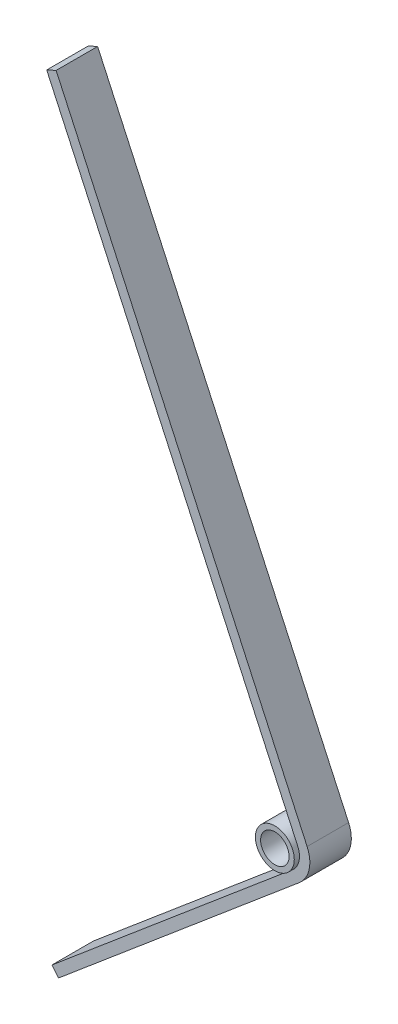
ISO-10303-21;
HEADER;
FILE_DESCRIPTION(('STEP AP214'),'2;1');
FILE_NAME('part.step','',(''),(''),'','','');
FILE_SCHEMA(('AUTOMOTIVE_DESIGN { 1 0 10303 214 1 1 1 1 }'));
ENDSEC;
DATA;
#1=APPLICATION_CONTEXT('core data for automotive mechanical design processes');
#2=APPLICATION_PROTOCOL_DEFINITION('international standard','automotive_design',2000,#1);
#3=PRODUCT_CONTEXT('',#1,'mechanical');
#4=PRODUCT('Part','Part','',(#3));
#5=PRODUCT_RELATED_PRODUCT_CATEGORY('part','',(#4));
#6=PRODUCT_DEFINITION_FORMATION('','',#4);
#7=PRODUCT_DEFINITION_CONTEXT('part definition',#1,'design');
#8=PRODUCT_DEFINITION('design','',#6,#7);
#9=PRODUCT_DEFINITION_SHAPE('','',#8);
#10=(LENGTH_UNIT() NAMED_UNIT(*) SI_UNIT(.MILLI.,.METRE.));
#11=(NAMED_UNIT(*) PLANE_ANGLE_UNIT() SI_UNIT($,.RADIAN.));
#12=(NAMED_UNIT(*) SI_UNIT($,.STERADIAN.) SOLID_ANGLE_UNIT());
#13=UNCERTAINTY_MEASURE_WITH_UNIT(LENGTH_MEASURE(1.E-05),#10,'distance_accuracy_value','');
#14=(GEOMETRIC_REPRESENTATION_CONTEXT(3) GLOBAL_UNCERTAINTY_ASSIGNED_CONTEXT((#13)) GLOBAL_UNIT_ASSIGNED_CONTEXT((#10,
#11,#12)) REPRESENTATION_CONTEXT('',''));
#15=CARTESIAN_POINT('',(0.,0.,0.));
#16=DIRECTION('',(0.,0.,1.));
#17=DIRECTION('',(1.,0.,0.));
#18=AXIS2_PLACEMENT_3D('',#15,#16,#17);
#19=CARTESIAN_POINT('',(0.,0.,15.875));
#20=DIRECTION('',(0.,0.,1.));
#21=DIRECTION('',(1.,0.,0.));
#22=AXIS2_PLACEMENT_3D('',#19,#20,#21);
#23=PLANE('',#22);
#24=CARTESIAN_POINT('',(0.,0.,15.875));
#25=DIRECTION('',(0.,0.,1.));
#26=DIRECTION('',(1.,0.,0.));
#27=AXIS2_PLACEMENT_3D('',#24,#25,#26);
#28=CIRCLE('',#27,11.90625);
#29=CARTESIAN_POINT('',(11.90625,0.,15.875));
#30=VERTEX_POINT('',#29);
#31=EDGE_CURVE('E11',#30,#30,#28,.T.);
#32=ORIENTED_EDGE('',*,*,#31,.T.);
#33=EDGE_LOOP('',(#32));
#34=FACE_BOUND('',#33,.T.);
#35=CARTESIAN_POINT('',(0.,0.,15.875));
#36=DIRECTION('',(0.,0.,1.));
#37=DIRECTION('',(1.,0.,0.));
#38=AXIS2_PLACEMENT_3D('',#35,#36,#37);
#39=CIRCLE('',#38,8.73125);
#40=CARTESIAN_POINT('',(8.73125,0.,15.875));
#41=VERTEX_POINT('',#40);
#42=EDGE_CURVE('E203',#41,#41,#39,.T.);
#43=ORIENTED_EDGE('',*,*,#42,.F.);
#44=EDGE_LOOP('',(#43));
#45=FACE_BOUND('',#44,.T.);
#46=ADVANCED_FACE('F44',(#34,#45),#23,.T.);
#47=CARTESIAN_POINT('',(0.,0.,-15.875));
#48=DIRECTION('',(0.,0.,1.));
#49=DIRECTION('',(1.,0.,0.));
#50=AXIS2_PLACEMENT_3D('',#47,#48,#49);
#51=PLANE('',#50);
#52=CARTESIAN_POINT('',(0.,0.,-15.875));
#53=DIRECTION('',(0.,0.,1.));
#54=DIRECTION('',(1.,0.,0.));
#55=AXIS2_PLACEMENT_3D('',#52,#53,#54);
#56=CIRCLE('',#55,11.90625);
#57=CARTESIAN_POINT('',(11.90625,0.,-15.875));
#58=VERTEX_POINT('',#57);
#59=EDGE_CURVE('E47',#58,#58,#56,.T.);
#60=ORIENTED_EDGE('',*,*,#59,.F.);
#61=EDGE_LOOP('',(#60));
#62=FACE_BOUND('',#61,.T.);
#63=CARTESIAN_POINT('',(0.,0.,-15.875));
#64=DIRECTION('',(0.,0.,1.));
#65=DIRECTION('',(1.,0.,0.));
#66=AXIS2_PLACEMENT_3D('',#63,#64,#65);
#67=CIRCLE('',#66,8.73125);
#68=CARTESIAN_POINT('',(8.73125,0.,-15.875));
#69=VERTEX_POINT('',#68);
#70=EDGE_CURVE('E126',#69,#69,#67,.T.);
#71=ORIENTED_EDGE('',*,*,#70,.T.);
#72=EDGE_LOOP('',(#71));
#73=FACE_BOUND('',#72,.T.);
#74=ADVANCED_FACE('F215',(#62,#73),#51,.F.);
#75=CARTESIAN_POINT('',(0.,0.,15.875));
#76=DIRECTION('',(0.,0.,-1.));
#77=DIRECTION('',(-1.,0.,0.));
#78=AXIS2_PLACEMENT_3D('',#75,#76,#77);
#79=CYLINDRICAL_SURFACE('',#78,11.90625);
#80=DIRECTION('',(0.,0.,-1.));
#81=VECTOR('',#80,1.);
#82=CARTESIAN_POINT('',(7.67438496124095,-9.1028898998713,12.7));
#83=LINE('',#82,#81);
#84=CARTESIAN_POINT('',(7.67438496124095,-9.10288989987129,12.7));
#85=VERTEX_POINT('',#84);
#86=CARTESIAN_POINT('',(7.67438496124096,-9.1028898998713,-12.7));
#87=VERTEX_POINT('',#86);
#88=EDGE_CURVE('E62',#85,#87,#83,.T.);
#89=ORIENTED_EDGE('',*,*,#88,.F.);
#90=CARTESIAN_POINT('',(0.,0.,12.7));
#91=DIRECTION('',(0.,0.,-1.));
#92=DIRECTION('',(1.,0.,0.));
#93=AXIS2_PLACEMENT_3D('',#90,#91,#92);
#94=CIRCLE('',#93,11.90625);
#95=CARTESIAN_POINT('',(10.8203069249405,4.96787148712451,12.7));
#96=VERTEX_POINT('',#95);
#97=EDGE_CURVE('E63',#96,#85,#94,.T.);
#98=ORIENTED_EDGE('',*,*,#97,.F.);
#99=DIRECTION('',(0.,0.,-1.));
#100=VECTOR('',#99,1.);
#101=CARTESIAN_POINT('',(10.8203069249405,4.96787148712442,12.7));
#102=LINE('',#101,#100);
#103=CARTESIAN_POINT('',(10.8203069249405,4.96787148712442,-12.7));
#104=VERTEX_POINT('',#103);
#105=EDGE_CURVE('E187',#96,#104,#102,.T.);
#106=ORIENTED_EDGE('',*,*,#105,.T.);
#107=CARTESIAN_POINT('',(0.,0.,-12.7));
#108=DIRECTION('',(0.,0.,-1.));
#109=DIRECTION('',(1.,0.,0.));
#110=AXIS2_PLACEMENT_3D('',#107,#108,#109);
#111=CIRCLE('',#110,11.90625);
#112=EDGE_CURVE('E117',#104,#87,#111,.T.);
#113=ORIENTED_EDGE('',*,*,#112,.T.);
#114=EDGE_LOOP('',(#89,#98,#106,#113));
#115=FACE_BOUND('',#114,.T.);
#116=ORIENTED_EDGE('',*,*,#31,.F.);
#117=EDGE_LOOP('',(#116));
#118=FACE_BOUND('',#117,.T.);
#119=ORIENTED_EDGE('',*,*,#59,.T.);
#120=EDGE_LOOP('',(#119));
#121=FACE_BOUND('',#120,.T.);
#122=ADVANCED_FACE('F50',(#115,#118,#121),#79,.T.);
#123=CARTESIAN_POINT('',(0.,0.,15.875));
#124=DIRECTION('',(0.,0.,-1.));
#125=DIRECTION('',(-1.,0.,0.));
#126=AXIS2_PLACEMENT_3D('',#123,#124,#125);
#127=CYLINDRICAL_SURFACE('',#126,8.73125);
#128=ORIENTED_EDGE('',*,*,#42,.T.);
#129=EDGE_LOOP('',(#128));
#130=FACE_BOUND('',#129,.T.);
#131=ORIENTED_EDGE('',*,*,#70,.F.);
#132=EDGE_LOOP('',(#131));
#133=FACE_BOUND('',#132,.T.);
#134=ADVANCED_FACE('F211',(#130,#133),#127,.F.);
#135=CARTESIAN_POINT('',(7.67438496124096,-9.1028898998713,12.7));
#136=DIRECTION('',(0.644567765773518,-0.764547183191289,0.));
#137=DIRECTION('',(0.764547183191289,0.644567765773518,0.));
#138=AXIS2_PLACEMENT_3D('',#135,#136,#137);
#139=PLANE('',#138);
#140=DIRECTION('',(-0.764547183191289,-0.644567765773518,0.));
#141=VECTOR('',#140,1.);
#142=CARTESIAN_POINT('',(7.67438496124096,-9.1028898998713,-12.7));
#143=LINE('',#142,#141);
#144=CARTESIAN_POINT('',(-139.699999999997,-133.35,-12.7));
#145=VERTEX_POINT('',#144);
#146=EDGE_CURVE('E121',#87,#145,#143,.T.);
#147=ORIENTED_EDGE('',*,*,#146,.T.);
#148=DIRECTION('',(0.,0.,-1.));
#149=VECTOR('',#148,1.);
#150=CARTESIAN_POINT('',(-139.699999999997,-133.35,12.7));
#151=LINE('',#150,#149);
#152=CARTESIAN_POINT('',(-139.699999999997,-133.35,12.7));
#153=VERTEX_POINT('',#152);
#154=EDGE_CURVE('E122',#153,#145,#151,.T.);
#155=ORIENTED_EDGE('',*,*,#154,.F.);
#156=DIRECTION('',(-0.764547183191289,-0.644567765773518,0.));
#157=VECTOR('',#156,1.);
#158=CARTESIAN_POINT('',(7.67438496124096,-9.1028898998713,12.7));
#159=LINE('',#158,#157);
#160=EDGE_CURVE('E107',#85,#153,#159,.T.);
#161=ORIENTED_EDGE('',*,*,#160,.F.);
#162=ORIENTED_EDGE('',*,*,#88,.T.);
#163=EDGE_LOOP('',(#147,#155,#161,#162));
#164=FACE_BOUND('',#163,.T.);
#165=ADVANCED_FACE('F125',(#164),#139,.F.);
#166=CARTESIAN_POINT('',(-135.606994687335,-138.204874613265,12.7));
#167=DIRECTION('',(-0.764547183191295,-0.644567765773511,0.));
#168=DIRECTION('',(0.644567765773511,-0.764547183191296,0.));
#169=AXIS2_PLACEMENT_3D('',#166,#167,#168);
#170=PLANE('',#169);
#171=DIRECTION('',(-0.644567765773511,0.764547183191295,0.));
#172=VECTOR('',#171,1.);
#173=CARTESIAN_POINT('',(-135.606994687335,-138.204874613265,-12.7));
#174=LINE('',#173,#172);
#175=CARTESIAN_POINT('',(-135.606994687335,-138.204874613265,-12.7));
#176=VERTEX_POINT('',#175);
#177=EDGE_CURVE('E156',#176,#145,#174,.T.);
#178=ORIENTED_EDGE('',*,*,#177,.F.);
#179=DIRECTION('',(0.,0.,-1.));
#180=VECTOR('',#179,1.);
#181=CARTESIAN_POINT('',(-135.606994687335,-138.204874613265,12.7));
#182=LINE('',#181,#180);
#183=CARTESIAN_POINT('',(-135.606994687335,-138.204874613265,12.7));
#184=VERTEX_POINT('',#183);
#185=EDGE_CURVE('E128',#184,#176,#182,.T.);
#186=ORIENTED_EDGE('',*,*,#185,.F.);
#187=DIRECTION('',(-0.644567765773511,0.764547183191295,0.));
#188=VECTOR('',#187,1.);
#189=CARTESIAN_POINT('',(-135.606994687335,-138.204874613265,12.7));
#190=LINE('',#189,#188);
#191=EDGE_CURVE('E112',#184,#153,#190,.T.);
#192=ORIENTED_EDGE('',*,*,#191,.T.);
#193=ORIENTED_EDGE('',*,*,#154,.T.);
#194=EDGE_LOOP('',(#178,#186,#192,#193));
#195=FACE_BOUND('',#194,.T.);
#196=ADVANCED_FACE('F135',(#195),#170,.T.);
#197=CARTESIAN_POINT('',(11.7673902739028,-13.957764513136,12.7));
#198=DIRECTION('',(0.644567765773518,-0.764547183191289,0.));
#199=DIRECTION('',(0.764547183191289,0.644567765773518,0.));
#200=AXIS2_PLACEMENT_3D('',#197,#198,#199);
#201=PLANE('',#200);
#202=DIRECTION('',(-0.764547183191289,-0.644567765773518,0.));
#203=VECTOR('',#202,1.);
#204=CARTESIAN_POINT('',(11.7673902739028,-13.957764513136,-12.7));
#205=LINE('',#204,#203);
#206=CARTESIAN_POINT('',(11.7673902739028,-13.957764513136,-12.7));
#207=VERTEX_POINT('',#206);
#208=EDGE_CURVE('E162',#207,#176,#205,.T.);
#209=ORIENTED_EDGE('',*,*,#208,.F.);
#210=DIRECTION('',(0.,0.,-1.));
#211=VECTOR('',#210,1.);
#212=CARTESIAN_POINT('',(11.7673902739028,-13.957764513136,12.7));
#213=LINE('',#212,#211);
#214=CARTESIAN_POINT('',(11.7673902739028,-13.957764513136,12.7));
#215=VERTEX_POINT('',#214);
#216=EDGE_CURVE('E196',#215,#207,#213,.T.);
#217=ORIENTED_EDGE('',*,*,#216,.F.);
#218=DIRECTION('',(-0.764547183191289,-0.644567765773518,0.));
#219=VECTOR('',#218,1.);
#220=CARTESIAN_POINT('',(11.7673902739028,-13.957764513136,12.7));
#221=LINE('',#220,#219);
#222=EDGE_CURVE('E132',#215,#184,#221,.T.);
#223=ORIENTED_EDGE('',*,*,#222,.T.);
#224=ORIENTED_EDGE('',*,*,#185,.T.);
#225=EDGE_LOOP('',(#209,#217,#223,#224));
#226=FACE_BOUND('',#225,.T.);
#227=ADVANCED_FACE('F262',(#226),#201,.T.);
#228=CARTESIAN_POINT('',(0.,0.,12.7));
#229=DIRECTION('',(0.,0.,-1.));
#230=DIRECTION('',(-1.,0.,0.));
#231=AXIS2_PLACEMENT_3D('',#228,#229,#230);
#232=CYLINDRICAL_SURFACE('',#231,18.25625);
#233=CARTESIAN_POINT('',(0.,0.,-12.7));
#234=DIRECTION('',(0.,0.,1.));
#235=DIRECTION('',(1.,0.,0.));
#236=AXIS2_PLACEMENT_3D('',#233,#234,#235);
#237=CIRCLE('',#236,18.25625);
#238=CARTESIAN_POINT('',(16.5911372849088,7.61740294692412,-12.7));
#239=VERTEX_POINT('',#238);
#240=EDGE_CURVE('E168',#239,#207,#237,.F.);
#241=ORIENTED_EDGE('',*,*,#240,.F.);
#242=DIRECTION('',(0.,0.,-1.));
#243=VECTOR('',#242,1.);
#244=CARTESIAN_POINT('',(16.5911372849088,7.61740294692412,12.7));
#245=LINE('',#244,#243);
#246=CARTESIAN_POINT('',(16.5911372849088,7.61740294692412,12.7));
#247=VERTEX_POINT('',#246);
#248=EDGE_CURVE('E193',#247,#239,#245,.T.);
#249=ORIENTED_EDGE('',*,*,#248,.F.);
#250=CARTESIAN_POINT('',(0.,0.,12.7));
#251=DIRECTION('',(0.,0.,1.));
#252=DIRECTION('',(1.,0.,0.));
#253=AXIS2_PLACEMENT_3D('',#250,#251,#252);
#254=CIRCLE('',#253,18.25625);
#255=EDGE_CURVE('E138',#247,#215,#254,.F.);
#256=ORIENTED_EDGE('',*,*,#255,.T.);
#257=ORIENTED_EDGE('',*,*,#216,.T.);
#258=EDGE_LOOP('',(#241,#249,#256,#257));
#259=FACE_BOUND('',#258,.T.);
#260=ADVANCED_FACE('F271',(#259),#232,.T.);
#261=CARTESIAN_POINT('',(16.5911372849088,7.61740294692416,12.7));
#262=DIRECTION('',(0.908792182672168,0.41724904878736,0.));
#263=DIRECTION('',(-0.41724904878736,0.908792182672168,0.));
#264=AXIS2_PLACEMENT_3D('',#261,#262,#263);
#265=PLANE('',#264);
#266=DIRECTION('',(0.41724904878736,-0.908792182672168,0.));
#267=VECTOR('',#266,1.);
#268=CARTESIAN_POINT('',(16.5911372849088,7.61740294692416,-12.7));
#269=LINE('',#268,#267);
#270=CARTESIAN_POINT('',(-137.104169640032,342.3745314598,-12.7));
#271=VERTEX_POINT('',#270);
#272=EDGE_CURVE('E167',#271,#239,#269,.T.);
#273=ORIENTED_EDGE('',*,*,#272,.F.);
#274=DIRECTION('',(0.,0.,-1.));
#275=VECTOR('',#274,1.);
#276=CARTESIAN_POINT('',(-137.104169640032,342.3745314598,12.7));
#277=LINE('',#276,#275);
#278=CARTESIAN_POINT('',(-137.104169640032,342.3745314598,12.7));
#279=VERTEX_POINT('',#278);
#280=EDGE_CURVE('E195',#279,#271,#277,.T.);
#281=ORIENTED_EDGE('',*,*,#280,.F.);
#282=DIRECTION('',(0.41724904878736,-0.908792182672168,0.));
#283=VECTOR('',#282,1.);
#284=CARTESIAN_POINT('',(16.5911372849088,7.61740294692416,12.7));
#285=LINE('',#284,#283);
#286=EDGE_CURVE('E144',#279,#247,#285,.T.);
#287=ORIENTED_EDGE('',*,*,#286,.T.);
#288=ORIENTED_EDGE('',*,*,#248,.T.);
#289=EDGE_LOOP('',(#273,#281,#287,#288));
#290=FACE_BOUND('',#289,.T.);
#291=ADVANCED_FACE('F281',(#290),#265,.T.);
#292=CARTESIAN_POINT('',(-142.875,339.725,12.7));
#293=DIRECTION('',(-0.417249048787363,0.908792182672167,0.));
#294=DIRECTION('',(-0.908792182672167,-0.417249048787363,0.));
#295=AXIS2_PLACEMENT_3D('',#292,#293,#294);
#296=PLANE('',#295);
#297=DIRECTION('',(0.908792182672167,0.417249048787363,0.));
#298=VECTOR('',#297,1.);
#299=CARTESIAN_POINT('',(-142.875,339.725,-12.7));
#300=LINE('',#299,#298);
#301=CARTESIAN_POINT('',(-142.875,339.725,-12.7));
#302=VERTEX_POINT('',#301);
#303=EDGE_CURVE('E172',#302,#271,#300,.T.);
#304=ORIENTED_EDGE('',*,*,#303,.F.);
#305=DIRECTION('',(0.,0.,-1.));
#306=VECTOR('',#305,1.);
#307=CARTESIAN_POINT('',(-142.875,339.725,12.7));
#308=LINE('',#307,#306);
#309=CARTESIAN_POINT('',(-142.875,339.725,12.7));
#310=VERTEX_POINT('',#309);
#311=EDGE_CURVE('E186',#310,#302,#308,.T.);
#312=ORIENTED_EDGE('',*,*,#311,.F.);
#313=DIRECTION('',(0.908792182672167,0.417249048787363,0.));
#314=VECTOR('',#313,1.);
#315=CARTESIAN_POINT('',(-142.875,339.725,12.7));
#316=LINE('',#315,#314);
#317=EDGE_CURVE('E149',#310,#279,#316,.T.);
#318=ORIENTED_EDGE('',*,*,#317,.T.);
#319=ORIENTED_EDGE('',*,*,#280,.T.);
#320=EDGE_LOOP('',(#304,#312,#318,#319));
#321=FACE_BOUND('',#320,.T.);
#322=ADVANCED_FACE('F291',(#321),#296,.T.);
#323=CARTESIAN_POINT('',(10.8203069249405,4.96787148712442,12.7));
#324=DIRECTION('',(0.908792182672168,0.41724904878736,0.));
#325=DIRECTION('',(-0.41724904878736,0.908792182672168,0.));
#326=AXIS2_PLACEMENT_3D('',#323,#324,#325);
#327=PLANE('',#326);
#328=DIRECTION('',(0.41724904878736,-0.908792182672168,0.));
#329=VECTOR('',#328,1.);
#330=CARTESIAN_POINT('',(10.8203069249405,4.96787148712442,-12.7));
#331=LINE('',#330,#329);
#332=EDGE_CURVE('E178',#302,#104,#331,.T.);
#333=ORIENTED_EDGE('',*,*,#332,.T.);
#334=ORIENTED_EDGE('',*,*,#105,.F.);
#335=DIRECTION('',(0.41724904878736,-0.908792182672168,0.));
#336=VECTOR('',#335,1.);
#337=CARTESIAN_POINT('',(10.8203069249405,4.96787148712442,12.7));
#338=LINE('',#337,#336);
#339=EDGE_CURVE('E155',#310,#96,#338,.T.);
#340=ORIENTED_EDGE('',*,*,#339,.F.);
#341=ORIENTED_EDGE('',*,*,#311,.T.);
#342=EDGE_LOOP('',(#333,#334,#340,#341));
#343=FACE_BOUND('',#342,.T.);
#344=ADVANCED_FACE('F303',(#343),#327,.F.);
#345=CARTESIAN_POINT('',(0.,0.,12.7));
#346=DIRECTION('',(0.,0.,1.));
#347=DIRECTION('',(1.,0.,0.));
#348=AXIS2_PLACEMENT_3D('',#345,#346,#347);
#349=PLANE('',#348);
#350=ORIENTED_EDGE('',*,*,#160,.T.);
#351=ORIENTED_EDGE('',*,*,#191,.F.);
#352=ORIENTED_EDGE('',*,*,#222,.F.);
#353=ORIENTED_EDGE('',*,*,#255,.F.);
#354=ORIENTED_EDGE('',*,*,#286,.F.);
#355=ORIENTED_EDGE('',*,*,#317,.F.);
#356=ORIENTED_EDGE('',*,*,#339,.T.);
#357=ORIENTED_EDGE('',*,*,#97,.T.);
#358=EDGE_LOOP('',(#350,#351,#352,#353,#354,#355,#356,#357));
#359=FACE_BOUND('',#358,.T.);
#360=ADVANCED_FACE('F111',(#359),#349,.T.);
#361=CARTESIAN_POINT('',(0.,0.,-12.7));
#362=DIRECTION('',(0.,0.,1.));
#363=DIRECTION('',(1.,0.,0.));
#364=AXIS2_PLACEMENT_3D('',#361,#362,#363);
#365=PLANE('',#364);
#366=ORIENTED_EDGE('',*,*,#146,.F.);
#367=ORIENTED_EDGE('',*,*,#112,.F.);
#368=ORIENTED_EDGE('',*,*,#332,.F.);
#369=ORIENTED_EDGE('',*,*,#303,.T.);
#370=ORIENTED_EDGE('',*,*,#272,.T.);
#371=ORIENTED_EDGE('',*,*,#240,.T.);
#372=ORIENTED_EDGE('',*,*,#208,.T.);
#373=ORIENTED_EDGE('',*,*,#177,.T.);
#374=EDGE_LOOP('',(#366,#367,#368,#369,#370,#371,#372,#373));
#375=FACE_BOUND('',#374,.T.);
#376=ADVANCED_FACE('F325',(#375),#365,.F.);
#377=CLOSED_SHELL('',(#46,#74,#122,#134,#165,#196,#227,#260,#291,#322,#344,#360,#376));
#378=MANIFOLD_SOLID_BREP('B2',#377);
#379=ADVANCED_BREP_SHAPE_REPRESENTATION('',(#18,#378),#14);
#380=SHAPE_DEFINITION_REPRESENTATION(#9,#379);
ENDSEC;
END-ISO-10303-21;
